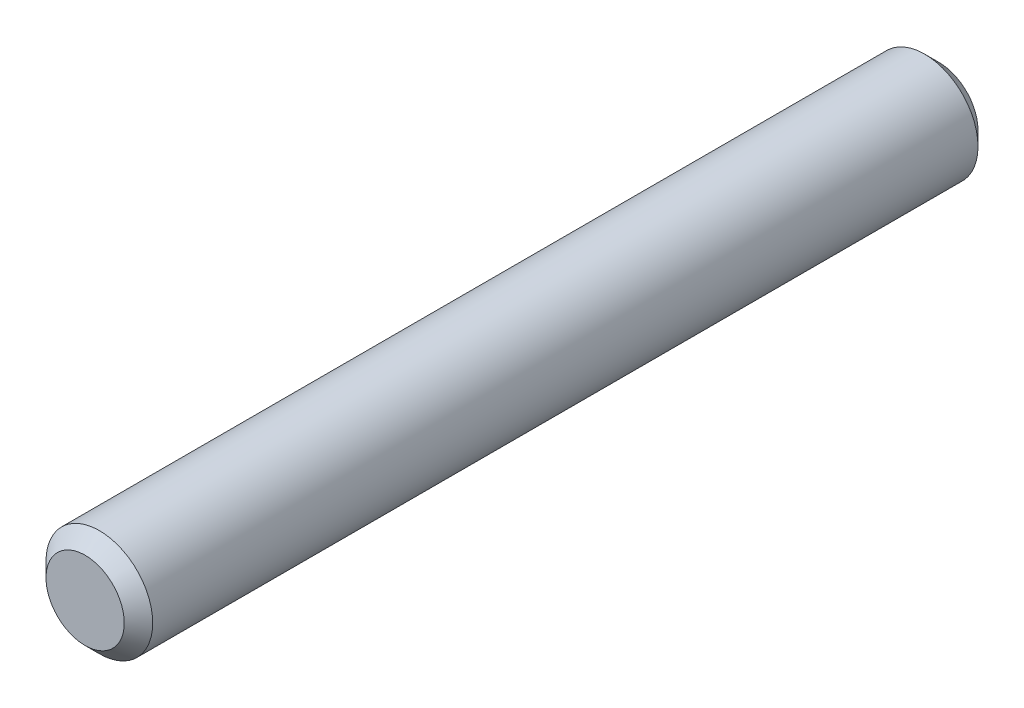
ISO-10303-21;
HEADER;
FILE_DESCRIPTION(('STEP AP214'),'2;1');
FILE_NAME('part.step','',(''),(''),'','','');
FILE_SCHEMA(('AUTOMOTIVE_DESIGN { 1 0 10303 214 1 1 1 1 }'));
ENDSEC;
DATA;
#1=APPLICATION_CONTEXT('core data for automotive mechanical design processes');
#2=APPLICATION_PROTOCOL_DEFINITION('international standard','automotive_design',2000,#1);
#3=PRODUCT_CONTEXT('',#1,'mechanical');
#4=PRODUCT('Part','Part','',(#3));
#5=PRODUCT_RELATED_PRODUCT_CATEGORY('part','',(#4));
#6=PRODUCT_DEFINITION_FORMATION('','',#4);
#7=PRODUCT_DEFINITION_CONTEXT('part definition',#1,'design');
#8=PRODUCT_DEFINITION('design','',#6,#7);
#9=PRODUCT_DEFINITION_SHAPE('','',#8);
#10=(LENGTH_UNIT() NAMED_UNIT(*) SI_UNIT(.MILLI.,.METRE.));
#11=(NAMED_UNIT(*) PLANE_ANGLE_UNIT() SI_UNIT($,.RADIAN.));
#12=(NAMED_UNIT(*) SI_UNIT($,.STERADIAN.) SOLID_ANGLE_UNIT());
#13=UNCERTAINTY_MEASURE_WITH_UNIT(LENGTH_MEASURE(1.E-05),#10,'distance_accuracy_value','');
#14=(GEOMETRIC_REPRESENTATION_CONTEXT(3) GLOBAL_UNCERTAINTY_ASSIGNED_CONTEXT((#13)) GLOBAL_UNIT_ASSIGNED_CONTEXT((#10,
#11,#12)) REPRESENTATION_CONTEXT('',''));
#15=CARTESIAN_POINT('',(0.,0.,0.));
#16=DIRECTION('',(0.,0.,1.));
#17=DIRECTION('',(1.,0.,0.));
#18=AXIS2_PLACEMENT_3D('',#15,#16,#17);
#19=CARTESIAN_POINT('',(0.,0.,-6.));
#20=DIRECTION('',(0.,0.,1.));
#21=DIRECTION('',(1.,0.,0.));
#22=AXIS2_PLACEMENT_3D('',#19,#20,#21);
#23=CYLINDRICAL_SURFACE('',#22,0.75);
#24=CARTESIAN_POINT('',(0.,0.,-5.8));
#25=DIRECTION('',(0.,0.,1.));
#26=DIRECTION('',(1.,0.,0.));
#27=AXIS2_PLACEMENT_3D('',#24,#25,#26);
#28=CIRCLE('',#27,0.75);
#29=CARTESIAN_POINT('',(0.75,0.,-5.8));
#30=VERTEX_POINT('',#29);
#31=EDGE_CURVE('E45',#30,#30,#28,.T.);
#32=ORIENTED_EDGE('',*,*,#31,.T.);
#33=EDGE_LOOP('',(#32));
#34=FACE_BOUND('',#33,.T.);
#35=CARTESIAN_POINT('',(0.,0.,5.8));
#36=DIRECTION('',(0.,0.,1.));
#37=DIRECTION('',(1.,0.,0.));
#38=AXIS2_PLACEMENT_3D('',#35,#36,#37);
#39=CIRCLE('',#38,0.75);
#40=CARTESIAN_POINT('',(0.75,0.,5.8));
#41=VERTEX_POINT('',#40);
#42=EDGE_CURVE('E49',#41,#41,#39,.F.);
#43=ORIENTED_EDGE('',*,*,#42,.T.);
#44=EDGE_LOOP('',(#43));
#45=FACE_BOUND('',#44,.T.);
#46=ADVANCED_FACE('F34',(#34,#45),#23,.T.);
#47=CARTESIAN_POINT('',(0.,0.,-6.));
#48=DIRECTION('',(0.,0.,1.));
#49=DIRECTION('',(1.,0.,0.));
#50=AXIS2_PLACEMENT_3D('',#47,#48,#49);
#51=PLANE('',#50);
#52=CARTESIAN_POINT('',(0.,0.,-6.));
#53=DIRECTION('',(0.,0.,1.));
#54=DIRECTION('',(1.,0.,0.));
#55=AXIS2_PLACEMENT_3D('',#52,#53,#54);
#56=CIRCLE('',#55,0.549999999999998);
#57=CARTESIAN_POINT('',(0.549999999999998,0.,-6.));
#58=VERTEX_POINT('',#57);
#59=EDGE_CURVE('E41',#58,#58,#56,.F.);
#60=ORIENTED_EDGE('',*,*,#59,.T.);
#61=EDGE_LOOP('',(#60));
#62=FACE_BOUND('',#61,.T.);
#63=ADVANCED_FACE('F65',(#62),#51,.F.);
#64=CARTESIAN_POINT('',(0.,0.,6.));
#65=DIRECTION('',(0.,0.,1.));
#66=DIRECTION('',(1.,0.,0.));
#67=AXIS2_PLACEMENT_3D('',#64,#65,#66);
#68=PLANE('',#67);
#69=CARTESIAN_POINT('',(0.,0.,6.));
#70=DIRECTION('',(0.,0.,1.));
#71=DIRECTION('',(1.,0.,0.));
#72=AXIS2_PLACEMENT_3D('',#69,#70,#71);
#73=CIRCLE('',#72,0.550000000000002);
#74=CARTESIAN_POINT('',(0.550000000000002,0.,6.));
#75=VERTEX_POINT('',#74);
#76=EDGE_CURVE('E10',#75,#75,#73,.T.);
#77=ORIENTED_EDGE('',*,*,#76,.T.);
#78=EDGE_LOOP('',(#77));
#79=FACE_BOUND('',#78,.T.);
#80=ADVANCED_FACE('F62',(#79),#68,.T.);
#81=CARTESIAN_POINT('',(0.,0.,-5.8));
#82=DIRECTION('',(0.,0.,1.));
#83=DIRECTION('',(1.,0.,0.));
#84=AXIS2_PLACEMENT_3D('',#81,#82,#83);
#85=CONICAL_SURFACE('',#84,0.75,0.785398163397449);
#86=ORIENTED_EDGE('',*,*,#59,.F.);
#87=EDGE_LOOP('',(#86));
#88=FACE_BOUND('',#87,.T.);
#89=ORIENTED_EDGE('',*,*,#31,.F.);
#90=EDGE_LOOP('',(#89));
#91=FACE_BOUND('',#90,.T.);
#92=ADVANCED_FACE('F58',(#88,#91),#85,.T.);
#93=CARTESIAN_POINT('',(0.,0.,6.));
#94=DIRECTION('',(0.,0.,-1.));
#95=DIRECTION('',(-1.,0.,0.));
#96=AXIS2_PLACEMENT_3D('',#93,#94,#95);
#97=CONICAL_SURFACE('',#96,0.550000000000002,0.785398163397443);
#98=ORIENTED_EDGE('',*,*,#42,.F.);
#99=EDGE_LOOP('',(#98));
#100=FACE_BOUND('',#99,.T.);
#101=ORIENTED_EDGE('',*,*,#76,.F.);
#102=EDGE_LOOP('',(#101));
#103=FACE_BOUND('',#102,.T.);
#104=ADVANCED_FACE('F36',(#100,#103),#97,.T.);
#105=CLOSED_SHELL('',(#46,#63,#80,#92,#104));
#106=MANIFOLD_SOLID_BREP('B2',#105);
#107=ADVANCED_BREP_SHAPE_REPRESENTATION('',(#18,#106),#14);
#108=SHAPE_DEFINITION_REPRESENTATION(#9,#107);
ENDSEC;
END-ISO-10303-21;
